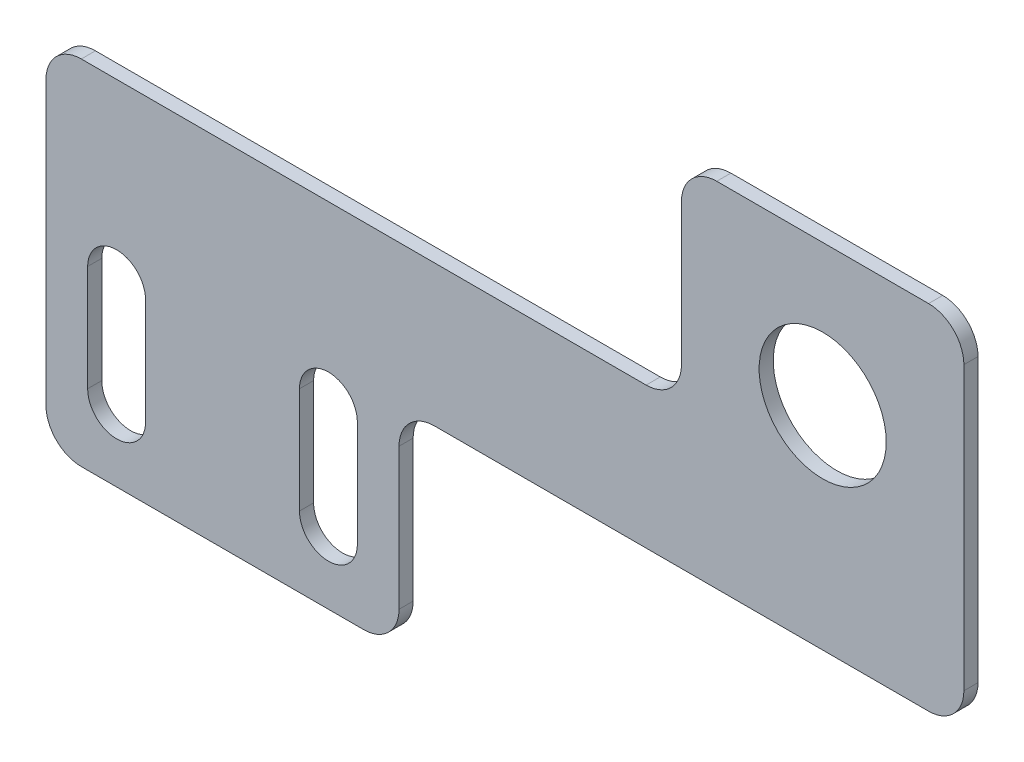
ISO-10303-21;
HEADER;
FILE_DESCRIPTION(('STEP AP214'),'2;1');
FILE_NAME('part.step','',(''),(''),'','','');
FILE_SCHEMA(('AUTOMOTIVE_DESIGN { 1 0 10303 214 1 1 1 1 }'));
ENDSEC;
DATA;
#1=APPLICATION_CONTEXT('core data for automotive mechanical design processes');
#2=APPLICATION_PROTOCOL_DEFINITION('international standard','automotive_design',2000,#1);
#3=PRODUCT_CONTEXT('',#1,'mechanical');
#4=PRODUCT('Part','Part','',(#3));
#5=PRODUCT_RELATED_PRODUCT_CATEGORY('part','',(#4));
#6=PRODUCT_DEFINITION_FORMATION('','',#4);
#7=PRODUCT_DEFINITION_CONTEXT('part definition',#1,'design');
#8=PRODUCT_DEFINITION('design','',#6,#7);
#9=PRODUCT_DEFINITION_SHAPE('','',#8);
#10=(LENGTH_UNIT() NAMED_UNIT(*) SI_UNIT(.MILLI.,.METRE.));
#11=(NAMED_UNIT(*) PLANE_ANGLE_UNIT() SI_UNIT($,.RADIAN.));
#12=(NAMED_UNIT(*) SI_UNIT($,.STERADIAN.) SOLID_ANGLE_UNIT());
#13=UNCERTAINTY_MEASURE_WITH_UNIT(LENGTH_MEASURE(1.E-05),#10,'distance_accuracy_value','');
#14=(GEOMETRIC_REPRESENTATION_CONTEXT(3) GLOBAL_UNCERTAINTY_ASSIGNED_CONTEXT((#13)) GLOBAL_UNIT_ASSIGNED_CONTEXT((#10,
#11,#12)) REPRESENTATION_CONTEXT('',''));
#15=CARTESIAN_POINT('',(0.,0.,0.));
#16=DIRECTION('',(0.,0.,1.));
#17=DIRECTION('',(1.,0.,0.));
#18=AXIS2_PLACEMENT_3D('',#15,#16,#17);
#19=CARTESIAN_POINT('',(40.,25.,5.));
#20=DIRECTION('',(0.,0.,1.));
#21=DIRECTION('',(1.,0.,0.));
#22=AXIS2_PLACEMENT_3D('',#19,#20,#21);
#23=CYLINDRICAL_SURFACE('',#22,4.10000000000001);
#24=DIRECTION('',(0.,0.,1.));
#25=VECTOR('',#24,1.);
#26=CARTESIAN_POINT('',(35.9,25.,5.));
#27=LINE('',#26,#25);
#28=CARTESIAN_POINT('',(35.9,25.,3.));
#29=VERTEX_POINT('',#28);
#30=CARTESIAN_POINT('',(35.9,25.,5.));
#31=VERTEX_POINT('',#30);
#32=EDGE_CURVE('E321',#29,#31,#27,.T.);
#33=ORIENTED_EDGE('',*,*,#32,.F.);
#34=CARTESIAN_POINT('',(40.,25.,3.));
#35=DIRECTION('',(0.,0.,1.));
#36=DIRECTION('',(1.,0.,0.));
#37=AXIS2_PLACEMENT_3D('',#34,#35,#36);
#38=CIRCLE('',#37,4.10000000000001);
#39=CARTESIAN_POINT('',(44.1,25.,3.));
#40=VERTEX_POINT('',#39);
#41=EDGE_CURVE('E307',#40,#29,#38,.T.);
#42=ORIENTED_EDGE('',*,*,#41,.F.);
#43=DIRECTION('',(0.,0.,1.));
#44=VECTOR('',#43,1.);
#45=CARTESIAN_POINT('',(44.1,25.,5.));
#46=LINE('',#45,#44);
#47=CARTESIAN_POINT('',(44.1,25.,5.));
#48=VERTEX_POINT('',#47);
#49=EDGE_CURVE('E319',#40,#48,#46,.T.);
#50=ORIENTED_EDGE('',*,*,#49,.T.);
#51=CARTESIAN_POINT('',(40.,25.,5.));
#52=DIRECTION('',(0.,0.,1.));
#53=DIRECTION('',(1.,0.,0.));
#54=AXIS2_PLACEMENT_3D('',#51,#52,#53);
#55=CIRCLE('',#54,4.10000000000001);
#56=EDGE_CURVE('E261',#48,#31,#55,.T.);
#57=ORIENTED_EDGE('',*,*,#56,.T.);
#58=EDGE_LOOP('',(#33,#42,#50,#57));
#59=FACE_BOUND('',#58,.T.);
#60=ADVANCED_FACE('F34',(#59),#23,.F.);
#61=CARTESIAN_POINT('',(44.1,10.,5.));
#62=DIRECTION('',(-1.,0.,0.));
#63=DIRECTION('',(0.,1.,0.));
#64=AXIS2_PLACEMENT_3D('',#61,#62,#63);
#65=PLANE('',#64);
#66=ORIENTED_EDGE('',*,*,#49,.F.);
#67=DIRECTION('',(0.,1.,0.));
#68=VECTOR('',#67,1.);
#69=CARTESIAN_POINT('',(44.1,0.,3.));
#70=LINE('',#69,#68);
#71=CARTESIAN_POINT('',(44.1,10.,3.));
#72=VERTEX_POINT('',#71);
#73=EDGE_CURVE('E219',#72,#40,#70,.T.);
#74=ORIENTED_EDGE('',*,*,#73,.F.);
#75=DIRECTION('',(0.,0.,1.));
#76=VECTOR('',#75,1.);
#77=CARTESIAN_POINT('',(44.1,10.,5.));
#78=LINE('',#77,#76);
#79=CARTESIAN_POINT('',(44.1,10.,5.));
#80=VERTEX_POINT('',#79);
#81=EDGE_CURVE('E317',#72,#80,#78,.T.);
#82=ORIENTED_EDGE('',*,*,#81,.T.);
#83=DIRECTION('',(0.,1.,0.));
#84=VECTOR('',#83,1.);
#85=CARTESIAN_POINT('',(44.1,10.,5.));
#86=LINE('',#85,#84);
#87=EDGE_CURVE('E208',#80,#48,#86,.T.);
#88=ORIENTED_EDGE('',*,*,#87,.T.);
#89=EDGE_LOOP('',(#66,#74,#82,#88));
#90=FACE_BOUND('',#89,.T.);
#91=ADVANCED_FACE('F465',(#90),#65,.T.);
#92=CARTESIAN_POINT('',(40.,10.,5.));
#93=DIRECTION('',(0.,0.,1.));
#94=DIRECTION('',(1.,0.,0.));
#95=AXIS2_PLACEMENT_3D('',#92,#93,#94);
#96=CYLINDRICAL_SURFACE('',#95,4.10000000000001);
#97=ORIENTED_EDGE('',*,*,#81,.F.);
#98=CARTESIAN_POINT('',(40.,10.,3.));
#99=DIRECTION('',(0.,0.,1.));
#100=DIRECTION('',(1.,0.,0.));
#101=AXIS2_PLACEMENT_3D('',#98,#99,#100);
#102=CIRCLE('',#101,4.10000000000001);
#103=CARTESIAN_POINT('',(35.9,10.,3.));
#104=VERTEX_POINT('',#103);
#105=EDGE_CURVE('E301',#104,#72,#102,.T.);
#106=ORIENTED_EDGE('',*,*,#105,.F.);
#107=DIRECTION('',(0.,0.,1.));
#108=VECTOR('',#107,1.);
#109=CARTESIAN_POINT('',(35.9,10.,5.));
#110=LINE('',#109,#108);
#111=CARTESIAN_POINT('',(35.9,10.,5.));
#112=VERTEX_POINT('',#111);
#113=EDGE_CURVE('E315',#104,#112,#110,.T.);
#114=ORIENTED_EDGE('',*,*,#113,.T.);
#115=CARTESIAN_POINT('',(40.,10.,5.));
#116=DIRECTION('',(0.,0.,1.));
#117=DIRECTION('',(1.,0.,0.));
#118=AXIS2_PLACEMENT_3D('',#115,#116,#117);
#119=CIRCLE('',#118,4.10000000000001);
#120=EDGE_CURVE('E255',#112,#80,#119,.T.);
#121=ORIENTED_EDGE('',*,*,#120,.T.);
#122=EDGE_LOOP('',(#97,#106,#114,#121));
#123=FACE_BOUND('',#122,.T.);
#124=ADVANCED_FACE('F471',(#123),#96,.F.);
#125=CARTESIAN_POINT('',(130.,30.,5.));
#126=DIRECTION('',(0.,1.,0.));
#127=DIRECTION('',(1.,0.,0.));
#128=AXIS2_PLACEMENT_3D('',#125,#126,#127);
#129=PLANE('',#128);
#130=DIRECTION('',(1.,0.,0.));
#131=VECTOR('',#130,1.);
#132=CARTESIAN_POINT('',(130.,30.,5.));
#133=LINE('',#132,#131);
#134=CARTESIAN_POINT('',(55.,30.,5.));
#135=VERTEX_POINT('',#134);
#136=CARTESIAN_POINT('',(125.,30.,5.));
#137=VERTEX_POINT('',#136);
#138=EDGE_CURVE('E234',#135,#137,#133,.T.);
#139=ORIENTED_EDGE('',*,*,#138,.F.);
#140=DIRECTION('',(0.,0.,-1.));
#141=VECTOR('',#140,1.);
#142=CARTESIAN_POINT('',(55.,30.,3.));
#143=LINE('',#142,#141);
#144=CARTESIAN_POINT('',(55.,30.,3.));
#145=VERTEX_POINT('',#144);
#146=EDGE_CURVE('E342',#135,#145,#143,.T.);
#147=ORIENTED_EDGE('',*,*,#146,.T.);
#148=DIRECTION('',(-1.,0.,0.));
#149=VECTOR('',#148,1.);
#150=CARTESIAN_POINT('',(0.,30.,3.));
#151=LINE('',#150,#149);
#152=CARTESIAN_POINT('',(125.,30.,3.));
#153=VERTEX_POINT('',#152);
#154=EDGE_CURVE('E294',#145,#153,#151,.F.);
#155=ORIENTED_EDGE('',*,*,#154,.T.);
#156=DIRECTION('',(0.,0.,-1.));
#157=VECTOR('',#156,1.);
#158=CARTESIAN_POINT('',(125.,30.,5.));
#159=LINE('',#158,#157);
#160=EDGE_CURVE('E339',#153,#137,#159,.F.);
#161=ORIENTED_EDGE('',*,*,#160,.T.);
#162=EDGE_LOOP('',(#139,#147,#155,#161));
#163=FACE_BOUND('',#162,.T.);
#164=ADVANCED_FACE('F396',(#163),#129,.F.);
#165=CARTESIAN_POINT('',(130.,80.,5.));
#166=DIRECTION('',(-1.,0.,0.));
#167=DIRECTION('',(0.,1.,0.));
#168=AXIS2_PLACEMENT_3D('',#165,#166,#167);
#169=PLANE('',#168);
#170=DIRECTION('',(0.,1.,0.));
#171=VECTOR('',#170,1.);
#172=CARTESIAN_POINT('',(130.,80.,5.));
#173=LINE('',#172,#171);
#174=CARTESIAN_POINT('',(130.,35.,5.));
#175=VERTEX_POINT('',#174);
#176=CARTESIAN_POINT('',(130.,75.,5.));
#177=VERTEX_POINT('',#176);
#178=EDGE_CURVE('E237',#175,#177,#173,.T.);
#179=ORIENTED_EDGE('',*,*,#178,.F.);
#180=DIRECTION('',(0.,0.,-1.));
#181=VECTOR('',#180,1.);
#182=CARTESIAN_POINT('',(130.,35.,5.));
#183=LINE('',#182,#181);
#184=CARTESIAN_POINT('',(130.,35.,3.));
#185=VERTEX_POINT('',#184);
#186=EDGE_CURVE('E56',#175,#185,#183,.T.);
#187=ORIENTED_EDGE('',*,*,#186,.T.);
#188=DIRECTION('',(0.,1.,0.));
#189=VECTOR('',#188,1.);
#190=CARTESIAN_POINT('',(130.,0.,3.));
#191=LINE('',#190,#189);
#192=CARTESIAN_POINT('',(130.,75.,3.));
#193=VERTEX_POINT('',#192);
#194=EDGE_CURVE('E292',#185,#193,#191,.T.);
#195=ORIENTED_EDGE('',*,*,#194,.T.);
#196=DIRECTION('',(0.,0.,-1.));
#197=VECTOR('',#196,1.);
#198=CARTESIAN_POINT('',(130.,75.,5.));
#199=LINE('',#198,#197);
#200=EDGE_CURVE('E377',#193,#177,#199,.F.);
#201=ORIENTED_EDGE('',*,*,#200,.T.);
#202=EDGE_LOOP('',(#179,#187,#195,#201));
#203=FACE_BOUND('',#202,.T.);
#204=ADVANCED_FACE('F453',(#203),#169,.F.);
#205=CARTESIAN_POINT('',(90.,80.,5.));
#206=DIRECTION('',(0.,-1.,0.));
#207=DIRECTION('',(-1.,0.,0.));
#208=AXIS2_PLACEMENT_3D('',#205,#206,#207);
#209=PLANE('',#208);
#210=DIRECTION('',(-1.,0.,0.));
#211=VECTOR('',#210,1.);
#212=CARTESIAN_POINT('',(0.,80.,3.));
#213=LINE('',#212,#211);
#214=CARTESIAN_POINT('',(125.,80.,3.));
#215=VERTEX_POINT('',#214);
#216=CARTESIAN_POINT('',(95.,80.,3.));
#217=VERTEX_POINT('',#216);
#218=EDGE_CURVE('E289',#215,#217,#213,.T.);
#219=ORIENTED_EDGE('',*,*,#218,.T.);
#220=DIRECTION('',(0.,0.,-1.));
#221=VECTOR('',#220,1.);
#222=CARTESIAN_POINT('',(95.,80.,5.));
#223=LINE('',#222,#221);
#224=CARTESIAN_POINT('',(95.,80.,5.));
#225=VERTEX_POINT('',#224);
#226=EDGE_CURVE('E383',#217,#225,#223,.F.);
#227=ORIENTED_EDGE('',*,*,#226,.T.);
#228=DIRECTION('',(-1.,0.,0.));
#229=VECTOR('',#228,1.);
#230=CARTESIAN_POINT('',(90.,80.,5.));
#231=LINE('',#230,#229);
#232=CARTESIAN_POINT('',(125.,80.,5.));
#233=VERTEX_POINT('',#232);
#234=EDGE_CURVE('E240',#233,#225,#231,.T.);
#235=ORIENTED_EDGE('',*,*,#234,.F.);
#236=DIRECTION('',(0.,0.,-1.));
#237=VECTOR('',#236,1.);
#238=CARTESIAN_POINT('',(125.,80.,5.));
#239=LINE('',#238,#237);
#240=EDGE_CURVE('E381',#233,#215,#239,.T.);
#241=ORIENTED_EDGE('',*,*,#240,.T.);
#242=EDGE_LOOP('',(#219,#227,#235,#241));
#243=FACE_BOUND('',#242,.T.);
#244=ADVANCED_FACE('F448',(#243),#209,.F.);
#245=CARTESIAN_POINT('',(90.,50.,5.));
#246=DIRECTION('',(1.,0.,0.));
#247=DIRECTION('',(0.,-1.,0.));
#248=AXIS2_PLACEMENT_3D('',#245,#246,#247);
#249=PLANE('',#248);
#250=DIRECTION('',(0.,1.,0.));
#251=VECTOR('',#250,1.);
#252=CARTESIAN_POINT('',(90.,0.,3.));
#253=LINE('',#252,#251);
#254=CARTESIAN_POINT('',(90.,75.,3.));
#255=VERTEX_POINT('',#254);
#256=CARTESIAN_POINT('',(90.,55.,3.));
#257=VERTEX_POINT('',#256);
#258=EDGE_CURVE('E286',#255,#257,#253,.F.);
#259=ORIENTED_EDGE('',*,*,#258,.T.);
#260=DIRECTION('',(0.,0.,-1.));
#261=VECTOR('',#260,1.);
#262=CARTESIAN_POINT('',(90.,55.,5.));
#263=LINE('',#262,#261);
#264=CARTESIAN_POINT('',(90.,55.,5.));
#265=VERTEX_POINT('',#264);
#266=EDGE_CURVE('E326',#257,#265,#263,.F.);
#267=ORIENTED_EDGE('',*,*,#266,.T.);
#268=DIRECTION('',(0.,-1.,0.));
#269=VECTOR('',#268,1.);
#270=CARTESIAN_POINT('',(90.,50.,5.));
#271=LINE('',#270,#269);
#272=CARTESIAN_POINT('',(90.,75.,5.));
#273=VERTEX_POINT('',#272);
#274=EDGE_CURVE('E243',#273,#265,#271,.T.);
#275=ORIENTED_EDGE('',*,*,#274,.F.);
#276=DIRECTION('',(0.,0.,-1.));
#277=VECTOR('',#276,1.);
#278=CARTESIAN_POINT('',(90.,75.,5.));
#279=LINE('',#278,#277);
#280=EDGE_CURVE('E323',#273,#255,#279,.T.);
#281=ORIENTED_EDGE('',*,*,#280,.T.);
#282=EDGE_LOOP('',(#259,#267,#275,#281));
#283=FACE_BOUND('',#282,.T.);
#284=ADVANCED_FACE('F441',(#283),#249,.F.);
#285=CARTESIAN_POINT('',(0.,50.,5.));
#286=DIRECTION('',(0.,-1.,0.));
#287=DIRECTION('',(-1.,0.,0.));
#288=AXIS2_PLACEMENT_3D('',#285,#286,#287);
#289=PLANE('',#288);
#290=DIRECTION('',(-1.,0.,0.));
#291=VECTOR('',#290,1.);
#292=CARTESIAN_POINT('',(0.,50.,5.));
#293=LINE('',#292,#291);
#294=CARTESIAN_POINT('',(85.,50.,5.));
#295=VERTEX_POINT('',#294);
#296=CARTESIAN_POINT('',(5.,50.,5.));
#297=VERTEX_POINT('',#296);
#298=EDGE_CURVE('E246',#295,#297,#293,.T.);
#299=ORIENTED_EDGE('',*,*,#298,.F.);
#300=DIRECTION('',(0.,0.,-1.));
#301=VECTOR('',#300,1.);
#302=CARTESIAN_POINT('',(85.,50.,3.));
#303=LINE('',#302,#301);
#304=CARTESIAN_POINT('',(85.,50.,3.));
#305=VERTEX_POINT('',#304);
#306=EDGE_CURVE('E332',#295,#305,#303,.T.);
#307=ORIENTED_EDGE('',*,*,#306,.T.);
#308=DIRECTION('',(-1.,0.,0.));
#309=VECTOR('',#308,1.);
#310=CARTESIAN_POINT('',(0.,50.,3.));
#311=LINE('',#310,#309);
#312=CARTESIAN_POINT('',(5.,50.,3.));
#313=VERTEX_POINT('',#312);
#314=EDGE_CURVE('E283',#305,#313,#311,.T.);
#315=ORIENTED_EDGE('',*,*,#314,.T.);
#316=DIRECTION('',(0.,0.,-1.));
#317=VECTOR('',#316,1.);
#318=CARTESIAN_POINT('',(5.,50.,5.));
#319=LINE('',#318,#317);
#320=EDGE_CURVE('E329',#313,#297,#319,.F.);
#321=ORIENTED_EDGE('',*,*,#320,.T.);
#322=EDGE_LOOP('',(#299,#307,#315,#321));
#323=FACE_BOUND('',#322,.T.);
#324=ADVANCED_FACE('F433',(#323),#289,.F.);
#325=CARTESIAN_POINT('',(0.,0.,5.));
#326=DIRECTION('',(1.,0.,0.));
#327=DIRECTION('',(0.,-1.,0.));
#328=AXIS2_PLACEMENT_3D('',#325,#326,#327);
#329=PLANE('',#328);
#330=DIRECTION('',(0.,-1.,0.));
#331=VECTOR('',#330,1.);
#332=CARTESIAN_POINT('',(0.,0.,5.));
#333=LINE('',#332,#331);
#334=CARTESIAN_POINT('',(0.,45.,5.));
#335=VERTEX_POINT('',#334);
#336=CARTESIAN_POINT('',(0.,5.,5.));
#337=VERTEX_POINT('',#336);
#338=EDGE_CURVE('E249',#335,#337,#333,.T.);
#339=ORIENTED_EDGE('',*,*,#338,.F.);
#340=DIRECTION('',(0.,0.,-1.));
#341=VECTOR('',#340,1.);
#342=CARTESIAN_POINT('',(0.,45.,5.));
#343=LINE('',#342,#341);
#344=CARTESIAN_POINT('',(0.,45.,3.));
#345=VERTEX_POINT('',#344);
#346=EDGE_CURVE('E359',#335,#345,#343,.T.);
#347=ORIENTED_EDGE('',*,*,#346,.T.);
#348=DIRECTION('',(0.,1.,0.));
#349=VECTOR('',#348,1.);
#350=CARTESIAN_POINT('',(0.,0.,3.));
#351=LINE('',#350,#349);
#352=CARTESIAN_POINT('',(0.,5.,3.));
#353=VERTEX_POINT('',#352);
#354=EDGE_CURVE('E279',#345,#353,#351,.F.);
#355=ORIENTED_EDGE('',*,*,#354,.T.);
#356=DIRECTION('',(0.,0.,-1.));
#357=VECTOR('',#356,1.);
#358=CARTESIAN_POINT('',(0.,5.,5.));
#359=LINE('',#358,#357);
#360=EDGE_CURVE('E356',#353,#337,#359,.F.);
#361=ORIENTED_EDGE('',*,*,#360,.T.);
#362=EDGE_LOOP('',(#339,#347,#355,#361));
#363=FACE_BOUND('',#362,.T.);
#364=ADVANCED_FACE('F424',(#363),#329,.F.);
#365=CARTESIAN_POINT('',(50.,0.,5.));
#366=DIRECTION('',(0.,1.,0.));
#367=DIRECTION('',(1.,0.,0.));
#368=AXIS2_PLACEMENT_3D('',#365,#366,#367);
#369=PLANE('',#368);
#370=DIRECTION('',(1.,0.,0.));
#371=VECTOR('',#370,1.);
#372=CARTESIAN_POINT('',(50.,0.,5.));
#373=LINE('',#372,#371);
#374=CARTESIAN_POINT('',(5.,0.,5.));
#375=VERTEX_POINT('',#374);
#376=CARTESIAN_POINT('',(45.,0.,5.));
#377=VERTEX_POINT('',#376);
#378=EDGE_CURVE('E228',#375,#377,#373,.T.);
#379=ORIENTED_EDGE('',*,*,#378,.F.);
#380=DIRECTION('',(0.,0.,-1.));
#381=VECTOR('',#380,1.);
#382=CARTESIAN_POINT('',(5.,0.,5.));
#383=LINE('',#382,#381);
#384=CARTESIAN_POINT('',(5.,0.,3.));
#385=VERTEX_POINT('',#384);
#386=EDGE_CURVE('E375',#375,#385,#383,.T.);
#387=ORIENTED_EDGE('',*,*,#386,.T.);
#388=DIRECTION('',(-1.,0.,0.));
#389=VECTOR('',#388,1.);
#390=CARTESIAN_POINT('',(0.,0.,3.));
#391=LINE('',#390,#389);
#392=CARTESIAN_POINT('',(45.,0.,3.));
#393=VERTEX_POINT('',#392);
#394=EDGE_CURVE('E271',#385,#393,#391,.F.);
#395=ORIENTED_EDGE('',*,*,#394,.T.);
#396=DIRECTION('',(0.,0.,-1.));
#397=VECTOR('',#396,1.);
#398=CARTESIAN_POINT('',(45.,0.,5.));
#399=LINE('',#398,#397);
#400=EDGE_CURVE('E372',#393,#377,#399,.F.);
#401=ORIENTED_EDGE('',*,*,#400,.T.);
#402=EDGE_LOOP('',(#379,#387,#395,#401));
#403=FACE_BOUND('',#402,.T.);
#404=ADVANCED_FACE('F416',(#403),#369,.F.);
#405=CARTESIAN_POINT('',(9.99999999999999,25.,5.));
#406=DIRECTION('',(0.,0.,1.));
#407=DIRECTION('',(1.,0.,0.));
#408=AXIS2_PLACEMENT_3D('',#405,#406,#407);
#409=CYLINDRICAL_SURFACE('',#408,4.1);
#410=DIRECTION('',(0.,0.,1.));
#411=VECTOR('',#410,1.);
#412=CARTESIAN_POINT('',(5.89999999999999,25.,5.));
#413=LINE('',#412,#411);
#414=CARTESIAN_POINT('',(5.89999999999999,25.,3.));
#415=VERTEX_POINT('',#414);
#416=CARTESIAN_POINT('',(5.89999999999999,25.,5.));
#417=VERTEX_POINT('',#416);
#418=EDGE_CURVE('E222',#415,#417,#413,.T.);
#419=ORIENTED_EDGE('',*,*,#418,.F.);
#420=CARTESIAN_POINT('',(9.99999999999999,25.,3.));
#421=DIRECTION('',(0.,0.,1.));
#422=DIRECTION('',(1.,0.,0.));
#423=AXIS2_PLACEMENT_3D('',#420,#421,#422);
#424=CIRCLE('',#423,4.1);
#425=CARTESIAN_POINT('',(14.1,25.,3.));
#426=VERTEX_POINT('',#425);
#427=EDGE_CURVE('E272',#426,#415,#424,.T.);
#428=ORIENTED_EDGE('',*,*,#427,.F.);
#429=DIRECTION('',(0.,0.,1.));
#430=VECTOR('',#429,1.);
#431=CARTESIAN_POINT('',(14.1,25.,5.));
#432=LINE('',#431,#430);
#433=CARTESIAN_POINT('',(14.1,25.,5.));
#434=VERTEX_POINT('',#433);
#435=EDGE_CURVE('E313',#426,#434,#432,.T.);
#436=ORIENTED_EDGE('',*,*,#435,.T.);
#437=CARTESIAN_POINT('',(9.99999999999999,25.,5.));
#438=DIRECTION('',(0.,0.,1.));
#439=DIRECTION('',(1.,0.,0.));
#440=AXIS2_PLACEMENT_3D('',#437,#438,#439);
#441=CIRCLE('',#440,4.1);
#442=EDGE_CURVE('E223',#434,#417,#441,.T.);
#443=ORIENTED_EDGE('',*,*,#442,.T.);
#444=EDGE_LOOP('',(#419,#428,#436,#443));
#445=FACE_BOUND('',#444,.T.);
#446=ADVANCED_FACE('F611',(#445),#409,.F.);
#447=CARTESIAN_POINT('',(14.1,9.99999999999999,5.));
#448=DIRECTION('',(-1.,0.,0.));
#449=DIRECTION('',(0.,1.,0.));
#450=AXIS2_PLACEMENT_3D('',#447,#448,#449);
#451=PLANE('',#450);
#452=ORIENTED_EDGE('',*,*,#435,.F.);
#453=DIRECTION('',(0.,1.,0.));
#454=VECTOR('',#453,1.);
#455=CARTESIAN_POINT('',(14.1,0.,3.));
#456=LINE('',#455,#454);
#457=CARTESIAN_POINT('',(14.1,9.99999999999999,3.));
#458=VERTEX_POINT('',#457);
#459=EDGE_CURVE('E268',#458,#426,#456,.T.);
#460=ORIENTED_EDGE('',*,*,#459,.F.);
#461=DIRECTION('',(0.,0.,1.));
#462=VECTOR('',#461,1.);
#463=CARTESIAN_POINT('',(14.1,9.99999999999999,5.));
#464=LINE('',#463,#462);
#465=CARTESIAN_POINT('',(14.1,9.99999999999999,5.));
#466=VERTEX_POINT('',#465);
#467=EDGE_CURVE('E207',#458,#466,#464,.T.);
#468=ORIENTED_EDGE('',*,*,#467,.T.);
#469=DIRECTION('',(0.,1.,0.));
#470=VECTOR('',#469,1.);
#471=CARTESIAN_POINT('',(14.1,9.99999999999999,5.));
#472=LINE('',#471,#470);
#473=EDGE_CURVE('E218',#466,#434,#472,.T.);
#474=ORIENTED_EDGE('',*,*,#473,.T.);
#475=EDGE_LOOP('',(#452,#460,#468,#474));
#476=FACE_BOUND('',#475,.T.);
#477=ADVANCED_FACE('F601',(#476),#451,.T.);
#478=CARTESIAN_POINT('',(9.99999999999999,9.99999999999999,5.));
#479=DIRECTION('',(0.,0.,1.));
#480=DIRECTION('',(1.,0.,0.));
#481=AXIS2_PLACEMENT_3D('',#478,#479,#480);
#482=CYLINDRICAL_SURFACE('',#481,4.1);
#483=ORIENTED_EDGE('',*,*,#467,.F.);
#484=CARTESIAN_POINT('',(9.99999999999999,9.99999999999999,3.));
#485=DIRECTION('',(0.,0.,1.));
#486=DIRECTION('',(1.,0.,0.));
#487=AXIS2_PLACEMENT_3D('',#484,#485,#486);
#488=CIRCLE('',#487,4.1);
#489=CARTESIAN_POINT('',(5.89999999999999,9.99999999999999,3.));
#490=VERTEX_POINT('',#489);
#491=EDGE_CURVE('E202',#490,#458,#488,.T.);
#492=ORIENTED_EDGE('',*,*,#491,.F.);
#493=DIRECTION('',(0.,0.,1.));
#494=VECTOR('',#493,1.);
#495=CARTESIAN_POINT('',(5.89999999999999,9.99999999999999,5.));
#496=LINE('',#495,#494);
#497=CARTESIAN_POINT('',(5.89999999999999,9.99999999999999,5.));
#498=VERTEX_POINT('',#497);
#499=EDGE_CURVE('E196',#490,#498,#496,.T.);
#500=ORIENTED_EDGE('',*,*,#499,.T.);
#501=CARTESIAN_POINT('',(9.99999999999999,9.99999999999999,5.));
#502=DIRECTION('',(0.,0.,1.));
#503=DIRECTION('',(1.,0.,0.));
#504=AXIS2_PLACEMENT_3D('',#501,#502,#503);
#505=CIRCLE('',#504,4.1);
#506=EDGE_CURVE('E199',#498,#466,#505,.T.);
#507=ORIENTED_EDGE('',*,*,#506,.T.);
#508=EDGE_LOOP('',(#483,#492,#500,#507));
#509=FACE_BOUND('',#508,.T.);
#510=ADVANCED_FACE('F198',(#509),#482,.F.);
#511=CARTESIAN_POINT('',(5.89999999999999,9.99999999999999,5.));
#512=DIRECTION('',(1.,0.,0.));
#513=DIRECTION('',(0.,-1.,0.));
#514=AXIS2_PLACEMENT_3D('',#511,#512,#513);
#515=PLANE('',#514);
#516=DIRECTION('',(0.,1.,0.));
#517=VECTOR('',#516,1.);
#518=CARTESIAN_POINT('',(5.89999999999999,0.,3.));
#519=LINE('',#518,#517);
#520=EDGE_CURVE('E267',#415,#490,#519,.F.);
#521=ORIENTED_EDGE('',*,*,#520,.F.);
#522=ORIENTED_EDGE('',*,*,#418,.T.);
#523=DIRECTION('',(0.,-1.,0.));
#524=VECTOR('',#523,1.);
#525=CARTESIAN_POINT('',(5.89999999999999,9.99999999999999,5.));
#526=LINE('',#525,#524);
#527=EDGE_CURVE('E215',#417,#498,#526,.T.);
#528=ORIENTED_EDGE('',*,*,#527,.T.);
#529=ORIENTED_EDGE('',*,*,#499,.F.);
#530=EDGE_LOOP('',(#521,#522,#528,#529));
#531=FACE_BOUND('',#530,.T.);
#532=ADVANCED_FACE('F221',(#531),#515,.T.);
#533=CARTESIAN_POINT('',(50.,30.,5.));
#534=DIRECTION('',(-1.,0.,0.));
#535=DIRECTION('',(0.,1.,0.));
#536=AXIS2_PLACEMENT_3D('',#533,#534,#535);
#537=PLANE('',#536);
#538=DIRECTION('',(0.,1.,0.));
#539=VECTOR('',#538,1.);
#540=CARTESIAN_POINT('',(50.,0.,3.));
#541=LINE('',#540,#539);
#542=CARTESIAN_POINT('',(50.,5.,3.));
#543=VERTEX_POINT('',#542);
#544=CARTESIAN_POINT('',(50.,25.,3.));
#545=VERTEX_POINT('',#544);
#546=EDGE_CURVE('E278',#543,#545,#541,.T.);
#547=ORIENTED_EDGE('',*,*,#546,.T.);
#548=DIRECTION('',(0.,0.,-1.));
#549=VECTOR('',#548,1.);
#550=CARTESIAN_POINT('',(50.,25.,5.));
#551=LINE('',#550,#549);
#552=CARTESIAN_POINT('',(50.,25.,5.));
#553=VERTEX_POINT('',#552);
#554=EDGE_CURVE('E336',#545,#553,#551,.F.);
#555=ORIENTED_EDGE('',*,*,#554,.T.);
#556=DIRECTION('',(0.,1.,0.));
#557=VECTOR('',#556,1.);
#558=CARTESIAN_POINT('',(50.,30.,5.));
#559=LINE('',#558,#557);
#560=CARTESIAN_POINT('',(50.,5.00000000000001,5.));
#561=VERTEX_POINT('',#560);
#562=EDGE_CURVE('E231',#561,#553,#559,.T.);
#563=ORIENTED_EDGE('',*,*,#562,.F.);
#564=DIRECTION('',(0.,0.,-1.));
#565=VECTOR('',#564,1.);
#566=CARTESIAN_POINT('',(50.,5.,5.));
#567=LINE('',#566,#565);
#568=EDGE_CURVE('E334',#561,#543,#567,.T.);
#569=ORIENTED_EDGE('',*,*,#568,.T.);
#570=EDGE_LOOP('',(#547,#555,#563,#569));
#571=FACE_BOUND('',#570,.T.);
#572=ADVANCED_FACE('F407',(#571),#537,.F.);
#573=CARTESIAN_POINT('',(110.,60.,5.));
#574=DIRECTION('',(0.,0.,1.));
#575=DIRECTION('',(1.,0.,0.));
#576=AXIS2_PLACEMENT_3D('',#573,#574,#575);
#577=CYLINDRICAL_SURFACE('',#576,8.99999999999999);
#578=CARTESIAN_POINT('',(110.,60.,5.));
#579=DIRECTION('',(0.,0.,1.));
#580=DIRECTION('',(1.,0.,0.));
#581=AXIS2_PLACEMENT_3D('',#578,#579,#580);
#582=CIRCLE('',#581,8.99999999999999);
#583=CARTESIAN_POINT('',(119.,60.,5.));
#584=VERTEX_POINT('',#583);
#585=EDGE_CURVE('E252',#584,#584,#582,.T.);
#586=ORIENTED_EDGE('',*,*,#585,.T.);
#587=EDGE_LOOP('',(#586));
#588=FACE_BOUND('',#587,.T.);
#589=CARTESIAN_POINT('',(110.,60.,3.));
#590=DIRECTION('',(0.,0.,1.));
#591=DIRECTION('',(1.,0.,0.));
#592=AXIS2_PLACEMENT_3D('',#589,#590,#591);
#593=CIRCLE('',#592,8.99999999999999);
#594=CARTESIAN_POINT('',(119.,60.,3.));
#595=VERTEX_POINT('',#594);
#596=EDGE_CURVE('E282',#595,#595,#593,.T.);
#597=ORIENTED_EDGE('',*,*,#596,.F.);
#598=EDGE_LOOP('',(#597));
#599=FACE_BOUND('',#598,.T.);
#600=ADVANCED_FACE('F479',(#588,#599),#577,.F.);
#601=CARTESIAN_POINT('',(35.9,10.,5.));
#602=DIRECTION('',(1.,0.,0.));
#603=DIRECTION('',(0.,-1.,0.));
#604=AXIS2_PLACEMENT_3D('',#601,#602,#603);
#605=PLANE('',#604);
#606=DIRECTION('',(0.,1.,0.));
#607=VECTOR('',#606,1.);
#608=CARTESIAN_POINT('',(35.9,0.,3.));
#609=LINE('',#608,#607);
#610=EDGE_CURVE('E304',#29,#104,#609,.F.);
#611=ORIENTED_EDGE('',*,*,#610,.F.);
#612=ORIENTED_EDGE('',*,*,#32,.T.);
#613=DIRECTION('',(0.,-1.,0.));
#614=VECTOR('',#613,1.);
#615=CARTESIAN_POINT('',(35.9,10.,5.));
#616=LINE('',#615,#614);
#617=EDGE_CURVE('E258',#31,#112,#616,.T.);
#618=ORIENTED_EDGE('',*,*,#617,.T.);
#619=ORIENTED_EDGE('',*,*,#113,.F.);
#620=EDGE_LOOP('',(#611,#612,#618,#619));
#621=FACE_BOUND('',#620,.T.);
#622=ADVANCED_FACE('F476',(#621),#605,.T.);
#623=CARTESIAN_POINT('',(0.,0.,5.));
#624=DIRECTION('',(0.,0.,-1.));
#625=DIRECTION('',(-1.,0.,0.));
#626=AXIS2_PLACEMENT_3D('',#623,#624,#625);
#627=PLANE('',#626);
#628=ORIENTED_EDGE('',*,*,#506,.F.);
#629=ORIENTED_EDGE('',*,*,#527,.F.);
#630=ORIENTED_EDGE('',*,*,#442,.F.);
#631=ORIENTED_EDGE('',*,*,#473,.F.);
#632=EDGE_LOOP('',(#628,#629,#630,#631));
#633=FACE_BOUND('',#632,.T.);
#634=ORIENTED_EDGE('',*,*,#298,.T.);
#635=CARTESIAN_POINT('',(5.,45.,5.));
#636=DIRECTION('',(0.,0.,-1.));
#637=DIRECTION('',(-1.,0.,0.));
#638=AXIS2_PLACEMENT_3D('',#635,#636,#637);
#639=CIRCLE('',#638,5.);
#640=EDGE_CURVE('E354',#297,#335,#639,.F.);
#641=ORIENTED_EDGE('',*,*,#640,.T.);
#642=ORIENTED_EDGE('',*,*,#338,.T.);
#643=CARTESIAN_POINT('',(5.,5.,5.));
#644=DIRECTION('',(0.,0.,-1.));
#645=DIRECTION('',(-1.,0.,0.));
#646=AXIS2_PLACEMENT_3D('',#643,#644,#645);
#647=CIRCLE('',#646,5.);
#648=EDGE_CURVE('E352',#337,#375,#647,.F.);
#649=ORIENTED_EDGE('',*,*,#648,.T.);
#650=ORIENTED_EDGE('',*,*,#378,.T.);
#651=CARTESIAN_POINT('',(45.,5.,5.));
#652=DIRECTION('',(0.,0.,-1.));
#653=DIRECTION('',(-1.,0.,0.));
#654=AXIS2_PLACEMENT_3D('',#651,#652,#653);
#655=CIRCLE('',#654,5.);
#656=EDGE_CURVE('E350',#377,#561,#655,.F.);
#657=ORIENTED_EDGE('',*,*,#656,.T.);
#658=ORIENTED_EDGE('',*,*,#562,.T.);
#659=CARTESIAN_POINT('',(55.,25.,5.));
#660=DIRECTION('',(0.,0.,-1.));
#661=DIRECTION('',(-1.,0.,0.));
#662=AXIS2_PLACEMENT_3D('',#659,#660,#661);
#663=CIRCLE('',#662,5.);
#664=EDGE_CURVE('E42',#553,#135,#663,.T.);
#665=ORIENTED_EDGE('',*,*,#664,.T.);
#666=ORIENTED_EDGE('',*,*,#138,.T.);
#667=CARTESIAN_POINT('',(125.,35.,5.));
#668=DIRECTION('',(0.,0.,-1.));
#669=DIRECTION('',(-1.,0.,0.));
#670=AXIS2_PLACEMENT_3D('',#667,#668,#669);
#671=CIRCLE('',#670,5.);
#672=EDGE_CURVE('E348',#137,#175,#671,.F.);
#673=ORIENTED_EDGE('',*,*,#672,.T.);
#674=ORIENTED_EDGE('',*,*,#178,.T.);
#675=CARTESIAN_POINT('',(125.,75.,5.));
#676=DIRECTION('',(0.,0.,-1.));
#677=DIRECTION('',(-1.,0.,0.));
#678=AXIS2_PLACEMENT_3D('',#675,#676,#677);
#679=CIRCLE('',#678,5.);
#680=EDGE_CURVE('E344',#177,#233,#679,.F.);
#681=ORIENTED_EDGE('',*,*,#680,.T.);
#682=ORIENTED_EDGE('',*,*,#234,.T.);
#683=CARTESIAN_POINT('',(95.,75.,5.));
#684=DIRECTION('',(0.,0.,-1.));
#685=DIRECTION('',(-1.,0.,0.));
#686=AXIS2_PLACEMENT_3D('',#683,#684,#685);
#687=CIRCLE('',#686,5.);
#688=EDGE_CURVE('E346',#225,#273,#687,.F.);
#689=ORIENTED_EDGE('',*,*,#688,.T.);
#690=ORIENTED_EDGE('',*,*,#274,.T.);
#691=CARTESIAN_POINT('',(85.,55.,5.));
#692=DIRECTION('',(0.,0.,-1.));
#693=DIRECTION('',(-1.,0.,0.));
#694=AXIS2_PLACEMENT_3D('',#691,#692,#693);
#695=CIRCLE('',#694,5.);
#696=EDGE_CURVE('E386',#265,#295,#695,.T.);
#697=ORIENTED_EDGE('',*,*,#696,.T.);
#698=EDGE_LOOP('',(#634,#641,#642,#649,#650,#657,#658,#665,#666,#673,#674,#681,#682,#689,#690,#697));
#699=FACE_BOUND('',#698,.T.);
#700=ORIENTED_EDGE('',*,*,#585,.F.);
#701=EDGE_LOOP('',(#700));
#702=FACE_BOUND('',#701,.T.);
#703=ORIENTED_EDGE('',*,*,#120,.F.);
#704=ORIENTED_EDGE('',*,*,#617,.F.);
#705=ORIENTED_EDGE('',*,*,#56,.F.);
#706=ORIENTED_EDGE('',*,*,#87,.F.);
#707=EDGE_LOOP('',(#703,#704,#705,#706));
#708=FACE_BOUND('',#707,.T.);
#709=ADVANCED_FACE('F212',(#633,#699,#702,#708),#627,.F.);
#710=CARTESIAN_POINT('',(0.,0.,3.));
#711=DIRECTION('',(0.,0.,-1.));
#712=DIRECTION('',(-1.,0.,0.));
#713=AXIS2_PLACEMENT_3D('',#710,#711,#712);
#714=PLANE('',#713);
#715=ORIENTED_EDGE('',*,*,#491,.T.);
#716=ORIENTED_EDGE('',*,*,#459,.T.);
#717=ORIENTED_EDGE('',*,*,#427,.T.);
#718=ORIENTED_EDGE('',*,*,#520,.T.);
#719=EDGE_LOOP('',(#715,#716,#717,#718));
#720=FACE_BOUND('',#719,.T.);
#721=ORIENTED_EDGE('',*,*,#354,.F.);
#722=CARTESIAN_POINT('',(5.,45.,3.));
#723=DIRECTION('',(0.,0.,-1.));
#724=DIRECTION('',(-1.,0.,0.));
#725=AXIS2_PLACEMENT_3D('',#722,#723,#724);
#726=CIRCLE('',#725,5.);
#727=EDGE_CURVE('E370',#345,#313,#726,.T.);
#728=ORIENTED_EDGE('',*,*,#727,.T.);
#729=ORIENTED_EDGE('',*,*,#314,.F.);
#730=CARTESIAN_POINT('',(85.,55.,3.));
#731=DIRECTION('',(0.,0.,-1.));
#732=DIRECTION('',(-1.,0.,0.));
#733=AXIS2_PLACEMENT_3D('',#730,#731,#732);
#734=CIRCLE('',#733,5.);
#735=EDGE_CURVE('E388',#305,#257,#734,.F.);
#736=ORIENTED_EDGE('',*,*,#735,.T.);
#737=ORIENTED_EDGE('',*,*,#258,.F.);
#738=CARTESIAN_POINT('',(95.,75.,3.));
#739=DIRECTION('',(0.,0.,-1.));
#740=DIRECTION('',(-1.,0.,0.));
#741=AXIS2_PLACEMENT_3D('',#738,#739,#740);
#742=CIRCLE('',#741,5.);
#743=EDGE_CURVE('E362',#255,#217,#742,.T.);
#744=ORIENTED_EDGE('',*,*,#743,.T.);
#745=ORIENTED_EDGE('',*,*,#218,.F.);
#746=CARTESIAN_POINT('',(125.,75.,3.));
#747=DIRECTION('',(0.,0.,-1.));
#748=DIRECTION('',(-1.,0.,0.));
#749=AXIS2_PLACEMENT_3D('',#746,#747,#748);
#750=CIRCLE('',#749,5.);
#751=EDGE_CURVE('E49',#215,#193,#750,.T.);
#752=ORIENTED_EDGE('',*,*,#751,.T.);
#753=ORIENTED_EDGE('',*,*,#194,.F.);
#754=CARTESIAN_POINT('',(125.,35.,3.));
#755=DIRECTION('',(0.,0.,-1.));
#756=DIRECTION('',(-1.,0.,0.));
#757=AXIS2_PLACEMENT_3D('',#754,#755,#756);
#758=CIRCLE('',#757,5.);
#759=EDGE_CURVE('E364',#185,#153,#758,.T.);
#760=ORIENTED_EDGE('',*,*,#759,.T.);
#761=ORIENTED_EDGE('',*,*,#154,.F.);
#762=CARTESIAN_POINT('',(55.,25.,3.));
#763=DIRECTION('',(0.,0.,-1.));
#764=DIRECTION('',(-1.,0.,0.));
#765=AXIS2_PLACEMENT_3D('',#762,#763,#764);
#766=CIRCLE('',#765,5.);
#767=EDGE_CURVE('E11',#145,#545,#766,.F.);
#768=ORIENTED_EDGE('',*,*,#767,.T.);
#769=ORIENTED_EDGE('',*,*,#546,.F.);
#770=CARTESIAN_POINT('',(45.,5.,3.));
#771=DIRECTION('',(0.,0.,-1.));
#772=DIRECTION('',(-1.,0.,0.));
#773=AXIS2_PLACEMENT_3D('',#770,#771,#772);
#774=CIRCLE('',#773,5.);
#775=EDGE_CURVE('E366',#543,#393,#774,.T.);
#776=ORIENTED_EDGE('',*,*,#775,.T.);
#777=ORIENTED_EDGE('',*,*,#394,.F.);
#778=CARTESIAN_POINT('',(5.,5.,3.));
#779=DIRECTION('',(0.,0.,-1.));
#780=DIRECTION('',(-1.,0.,0.));
#781=AXIS2_PLACEMENT_3D('',#778,#779,#780);
#782=CIRCLE('',#781,5.);
#783=EDGE_CURVE('E368',#385,#353,#782,.T.);
#784=ORIENTED_EDGE('',*,*,#783,.T.);
#785=EDGE_LOOP('',(#721,#728,#729,#736,#737,#744,#745,#752,#753,#760,#761,#768,#769,#776,#777,#784));
#786=FACE_BOUND('',#785,.T.);
#787=ORIENTED_EDGE('',*,*,#596,.T.);
#788=EDGE_LOOP('',(#787));
#789=FACE_BOUND('',#788,.T.);
#790=ORIENTED_EDGE('',*,*,#105,.T.);
#791=ORIENTED_EDGE('',*,*,#73,.T.);
#792=ORIENTED_EDGE('',*,*,#41,.T.);
#793=ORIENTED_EDGE('',*,*,#610,.T.);
#794=EDGE_LOOP('',(#790,#791,#792,#793));
#795=FACE_BOUND('',#794,.T.);
#796=ADVANCED_FACE('F403',(#720,#786,#789,#795),#714,.T.);
#797=CARTESIAN_POINT('',(85.,55.,5.));
#798=DIRECTION('',(0.,0.,-1.));
#799=DIRECTION('',(-1.,0.,0.));
#800=AXIS2_PLACEMENT_3D('',#797,#798,#799);
#801=CYLINDRICAL_SURFACE('',#800,5.);
#802=ORIENTED_EDGE('',*,*,#735,.F.);
#803=ORIENTED_EDGE('',*,*,#306,.F.);
#804=ORIENTED_EDGE('',*,*,#696,.F.);
#805=ORIENTED_EDGE('',*,*,#266,.F.);
#806=EDGE_LOOP('',(#802,#803,#804,#805));
#807=FACE_BOUND('',#806,.T.);
#808=ADVANCED_FACE('F436',(#807),#801,.F.);
#809=CARTESIAN_POINT('',(55.,25.,5.));
#810=DIRECTION('',(0.,0.,-1.));
#811=DIRECTION('',(-1.,0.,0.));
#812=AXIS2_PLACEMENT_3D('',#809,#810,#811);
#813=CYLINDRICAL_SURFACE('',#812,5.);
#814=ORIENTED_EDGE('',*,*,#767,.F.);
#815=ORIENTED_EDGE('',*,*,#146,.F.);
#816=ORIENTED_EDGE('',*,*,#664,.F.);
#817=ORIENTED_EDGE('',*,*,#554,.F.);
#818=EDGE_LOOP('',(#814,#815,#816,#817));
#819=FACE_BOUND('',#818,.T.);
#820=ADVANCED_FACE('F400',(#819),#813,.F.);
#821=CARTESIAN_POINT('',(5.,45.,5.));
#822=DIRECTION('',(0.,0.,1.));
#823=DIRECTION('',(1.,0.,0.));
#824=AXIS2_PLACEMENT_3D('',#821,#822,#823);
#825=CYLINDRICAL_SURFACE('',#824,5.);
#826=ORIENTED_EDGE('',*,*,#727,.F.);
#827=ORIENTED_EDGE('',*,*,#346,.F.);
#828=ORIENTED_EDGE('',*,*,#640,.F.);
#829=ORIENTED_EDGE('',*,*,#320,.F.);
#830=EDGE_LOOP('',(#826,#827,#828,#829));
#831=FACE_BOUND('',#830,.T.);
#832=ADVANCED_FACE('F427',(#831),#825,.T.);
#833=CARTESIAN_POINT('',(5.,5.,5.));
#834=DIRECTION('',(0.,0.,1.));
#835=DIRECTION('',(1.,0.,0.));
#836=AXIS2_PLACEMENT_3D('',#833,#834,#835);
#837=CYLINDRICAL_SURFACE('',#836,5.);
#838=ORIENTED_EDGE('',*,*,#783,.F.);
#839=ORIENTED_EDGE('',*,*,#386,.F.);
#840=ORIENTED_EDGE('',*,*,#648,.F.);
#841=ORIENTED_EDGE('',*,*,#360,.F.);
#842=EDGE_LOOP('',(#838,#839,#840,#841));
#843=FACE_BOUND('',#842,.T.);
#844=ADVANCED_FACE('F419',(#843),#837,.T.);
#845=CARTESIAN_POINT('',(45.,5.,5.));
#846=DIRECTION('',(0.,0.,1.));
#847=DIRECTION('',(1.,0.,0.));
#848=AXIS2_PLACEMENT_3D('',#845,#846,#847);
#849=CYLINDRICAL_SURFACE('',#848,5.);
#850=ORIENTED_EDGE('',*,*,#775,.F.);
#851=ORIENTED_EDGE('',*,*,#568,.F.);
#852=ORIENTED_EDGE('',*,*,#656,.F.);
#853=ORIENTED_EDGE('',*,*,#400,.F.);
#854=EDGE_LOOP('',(#850,#851,#852,#853));
#855=FACE_BOUND('',#854,.T.);
#856=ADVANCED_FACE('F410',(#855),#849,.T.);
#857=CARTESIAN_POINT('',(125.,35.,5.));
#858=DIRECTION('',(0.,0.,1.));
#859=DIRECTION('',(1.,0.,0.));
#860=AXIS2_PLACEMENT_3D('',#857,#858,#859);
#861=CYLINDRICAL_SURFACE('',#860,5.);
#862=ORIENTED_EDGE('',*,*,#759,.F.);
#863=ORIENTED_EDGE('',*,*,#186,.F.);
#864=ORIENTED_EDGE('',*,*,#672,.F.);
#865=ORIENTED_EDGE('',*,*,#160,.F.);
#866=EDGE_LOOP('',(#862,#863,#864,#865));
#867=FACE_BOUND('',#866,.T.);
#868=ADVANCED_FACE('F456',(#867),#861,.T.);
#869=CARTESIAN_POINT('',(95.,75.,5.));
#870=DIRECTION('',(0.,0.,1.));
#871=DIRECTION('',(1.,0.,0.));
#872=AXIS2_PLACEMENT_3D('',#869,#870,#871);
#873=CYLINDRICAL_SURFACE('',#872,5.);
#874=ORIENTED_EDGE('',*,*,#743,.F.);
#875=ORIENTED_EDGE('',*,*,#280,.F.);
#876=ORIENTED_EDGE('',*,*,#688,.F.);
#877=ORIENTED_EDGE('',*,*,#226,.F.);
#878=EDGE_LOOP('',(#874,#875,#876,#877));
#879=FACE_BOUND('',#878,.T.);
#880=ADVANCED_FACE('F445',(#879),#873,.T.);
#881=CARTESIAN_POINT('',(125.,75.,5.));
#882=DIRECTION('',(0.,0.,1.));
#883=DIRECTION('',(1.,0.,0.));
#884=AXIS2_PLACEMENT_3D('',#881,#882,#883);
#885=CYLINDRICAL_SURFACE('',#884,5.);
#886=ORIENTED_EDGE('',*,*,#751,.F.);
#887=ORIENTED_EDGE('',*,*,#240,.F.);
#888=ORIENTED_EDGE('',*,*,#680,.F.);
#889=ORIENTED_EDGE('',*,*,#200,.F.);
#890=EDGE_LOOP('',(#886,#887,#888,#889));
#891=FACE_BOUND('',#890,.T.);
#892=ADVANCED_FACE('F36',(#891),#885,.T.);
#893=CLOSED_SHELL('',(#60,#91,#124,#164,#204,#244,#284,#324,#364,#404,#446,#477,#510,#532,#572,
#600,#622,#709,#796,#808,#820,#832,#844,#856,#868,#880,#892));
#894=MANIFOLD_SOLID_BREP('B2',#893);
#895=ADVANCED_BREP_SHAPE_REPRESENTATION('',(#18,#894),#14);
#896=SHAPE_DEFINITION_REPRESENTATION(#9,#895);
ENDSEC;
END-ISO-10303-21;
